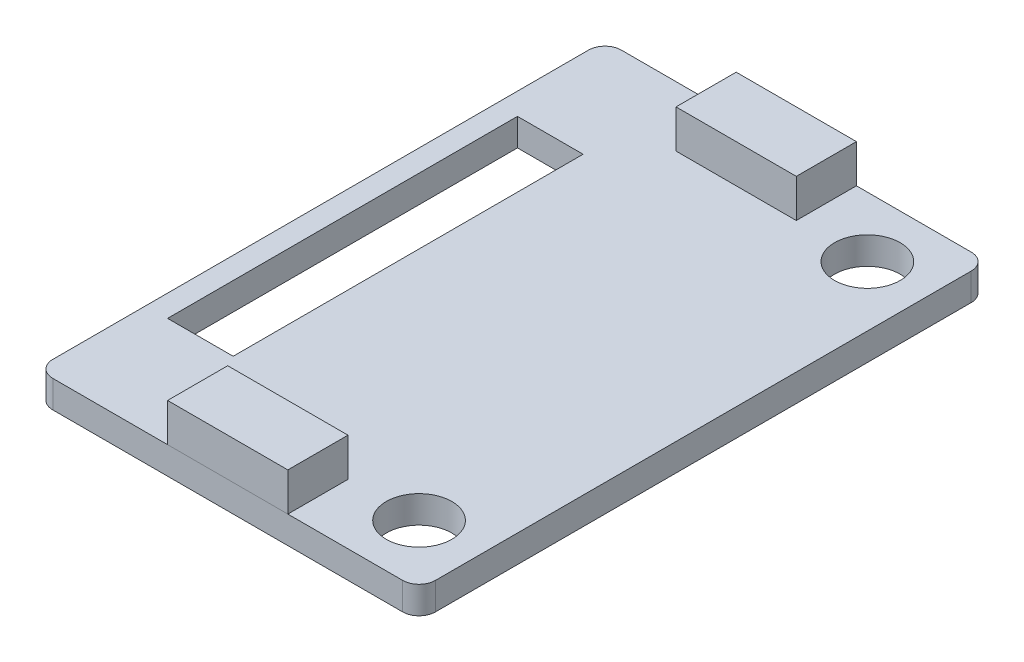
ISO-10303-21;
HEADER;
FILE_DESCRIPTION(('STEP AP214'),'2;1');
FILE_NAME('part.step','',(''),(''),'','','');
FILE_SCHEMA(('AUTOMOTIVE_DESIGN { 1 0 10303 214 1 1 1 1 }'));
ENDSEC;
DATA;
#1=APPLICATION_CONTEXT('core data for automotive mechanical design processes');
#2=APPLICATION_PROTOCOL_DEFINITION('international standard','automotive_design',2000,#1);
#3=PRODUCT_CONTEXT('',#1,'mechanical');
#4=PRODUCT('Part','Part','',(#3));
#5=PRODUCT_RELATED_PRODUCT_CATEGORY('part','',(#4));
#6=PRODUCT_DEFINITION_FORMATION('','',#4);
#7=PRODUCT_DEFINITION_CONTEXT('part definition',#1,'design');
#8=PRODUCT_DEFINITION('design','',#6,#7);
#9=PRODUCT_DEFINITION_SHAPE('','',#8);
#10=(LENGTH_UNIT() NAMED_UNIT(*) SI_UNIT(.MILLI.,.METRE.));
#11=(NAMED_UNIT(*) PLANE_ANGLE_UNIT() SI_UNIT($,.RADIAN.));
#12=(NAMED_UNIT(*) SI_UNIT($,.STERADIAN.) SOLID_ANGLE_UNIT());
#13=UNCERTAINTY_MEASURE_WITH_UNIT(LENGTH_MEASURE(1.E-05),#10,'distance_accuracy_value','');
#14=(GEOMETRIC_REPRESENTATION_CONTEXT(3) GLOBAL_UNCERTAINTY_ASSIGNED_CONTEXT((#13)) GLOBAL_UNIT_ASSIGNED_CONTEXT((#10,
#11,#12)) REPRESENTATION_CONTEXT('',''));
#15=CARTESIAN_POINT('',(0.,0.,0.));
#16=DIRECTION('',(0.,0.,1.));
#17=DIRECTION('',(1.,0.,0.));
#18=AXIS2_PLACEMENT_3D('',#15,#16,#17);
#19=CARTESIAN_POINT('',(-2.75,3.,-13.));
#20=DIRECTION('',(1.,0.,0.));
#21=DIRECTION('',(0.,0.,-1.));
#22=AXIS2_PLACEMENT_3D('',#19,#20,#21);
#23=PLANE('',#22);
#24=DIRECTION('',(0.,0.,1.));
#25=VECTOR('',#24,1.);
#26=CARTESIAN_POINT('',(-2.75,1.25,-13.));
#27=LINE('',#26,#25);
#28=CARTESIAN_POINT('',(-2.75,1.25,-13.));
#29=VERTEX_POINT('',#28);
#30=CARTESIAN_POINT('',(-2.75,1.25,-10.25));
#31=VERTEX_POINT('',#30);
#32=EDGE_CURVE('E115',#29,#31,#27,.T.);
#33=ORIENTED_EDGE('',*,*,#32,.T.);
#34=DIRECTION('',(0.,-1.,0.));
#35=VECTOR('',#34,1.);
#36=CARTESIAN_POINT('',(-2.75,3.,-10.25));
#37=LINE('',#36,#35);
#38=CARTESIAN_POINT('',(-2.75,3.,-10.25));
#39=VERTEX_POINT('',#38);
#40=EDGE_CURVE('E12',#39,#31,#37,.T.);
#41=ORIENTED_EDGE('',*,*,#40,.F.);
#42=DIRECTION('',(0.,0.,1.));
#43=VECTOR('',#42,1.);
#44=CARTESIAN_POINT('',(-2.75,3.,-13.));
#45=LINE('',#44,#43);
#46=CARTESIAN_POINT('',(-2.75,3.,-13.));
#47=VERTEX_POINT('',#46);
#48=EDGE_CURVE('E103',#47,#39,#45,.T.);
#49=ORIENTED_EDGE('',*,*,#48,.F.);
#50=DIRECTION('',(0.,-1.,0.));
#51=VECTOR('',#50,1.);
#52=CARTESIAN_POINT('',(-2.75,3.,-13.));
#53=LINE('',#52,#51);
#54=EDGE_CURVE('E111',#47,#29,#53,.T.);
#55=ORIENTED_EDGE('',*,*,#54,.T.);
#56=EDGE_LOOP('',(#33,#41,#49,#55));
#57=FACE_BOUND('',#56,.T.);
#58=ADVANCED_FACE('F52',(#57),#23,.F.);
#59=CARTESIAN_POINT('',(-2.75,3.,-10.25));
#60=DIRECTION('',(0.,0.,-1.));
#61=DIRECTION('',(-1.,0.,0.));
#62=AXIS2_PLACEMENT_3D('',#59,#60,#61);
#63=PLANE('',#62);
#64=DIRECTION('',(1.,0.,0.));
#65=VECTOR('',#64,1.);
#66=CARTESIAN_POINT('',(-2.75,1.25,-10.25));
#67=LINE('',#66,#65);
#68=CARTESIAN_POINT('',(2.75,1.25,-10.25));
#69=VERTEX_POINT('',#68);
#70=EDGE_CURVE('E107',#31,#69,#67,.T.);
#71=ORIENTED_EDGE('',*,*,#70,.T.);
#72=DIRECTION('',(0.,-1.,0.));
#73=VECTOR('',#72,1.);
#74=CARTESIAN_POINT('',(2.75,3.,-10.25));
#75=LINE('',#74,#73);
#76=CARTESIAN_POINT('',(2.75,3.,-10.25));
#77=VERTEX_POINT('',#76);
#78=EDGE_CURVE('E60',#77,#69,#75,.T.);
#79=ORIENTED_EDGE('',*,*,#78,.F.);
#80=DIRECTION('',(1.,0.,0.));
#81=VECTOR('',#80,1.);
#82=CARTESIAN_POINT('',(-2.75,3.,-10.25));
#83=LINE('',#82,#81);
#84=EDGE_CURVE('E98',#39,#77,#83,.T.);
#85=ORIENTED_EDGE('',*,*,#84,.F.);
#86=ORIENTED_EDGE('',*,*,#40,.T.);
#87=EDGE_LOOP('',(#71,#79,#85,#86));
#88=FACE_BOUND('',#87,.T.);
#89=ADVANCED_FACE('F106',(#88),#63,.F.);
#90=CARTESIAN_POINT('',(2.75,3.,-13.));
#91=DIRECTION('',(-1.,0.,0.));
#92=DIRECTION('',(0.,0.,1.));
#93=AXIS2_PLACEMENT_3D('',#90,#91,#92);
#94=PLANE('',#93);
#95=DIRECTION('',(0.,0.,-1.));
#96=VECTOR('',#95,1.);
#97=CARTESIAN_POINT('',(2.75,1.25,-13.));
#98=LINE('',#97,#96);
#99=CARTESIAN_POINT('',(2.75,1.25,-13.));
#100=VERTEX_POINT('',#99);
#101=EDGE_CURVE('E85',#69,#100,#98,.T.);
#102=ORIENTED_EDGE('',*,*,#101,.T.);
#103=DIRECTION('',(0.,-1.,0.));
#104=VECTOR('',#103,1.);
#105=CARTESIAN_POINT('',(2.75,3.,-13.));
#106=LINE('',#105,#104);
#107=CARTESIAN_POINT('',(2.75,3.,-13.));
#108=VERTEX_POINT('',#107);
#109=EDGE_CURVE('E108',#108,#100,#106,.T.);
#110=ORIENTED_EDGE('',*,*,#109,.F.);
#111=DIRECTION('',(0.,0.,-1.));
#112=VECTOR('',#111,1.);
#113=CARTESIAN_POINT('',(2.75,3.,-13.));
#114=LINE('',#113,#112);
#115=EDGE_CURVE('E101',#77,#108,#114,.T.);
#116=ORIENTED_EDGE('',*,*,#115,.F.);
#117=ORIENTED_EDGE('',*,*,#78,.T.);
#118=EDGE_LOOP('',(#102,#110,#116,#117));
#119=FACE_BOUND('',#118,.T.);
#120=ADVANCED_FACE('F109',(#119),#94,.F.);
#121=CARTESIAN_POINT('',(-2.75,3.,-13.));
#122=DIRECTION('',(0.,0.,1.));
#123=DIRECTION('',(1.,0.,0.));
#124=AXIS2_PLACEMENT_3D('',#121,#122,#123);
#125=PLANE('',#124);
#126=DIRECTION('',(-1.,0.,0.));
#127=VECTOR('',#126,1.);
#128=CARTESIAN_POINT('',(-2.75,1.25,-13.));
#129=LINE('',#128,#127);
#130=EDGE_CURVE('E91',#100,#29,#129,.T.);
#131=ORIENTED_EDGE('',*,*,#130,.T.);
#132=ORIENTED_EDGE('',*,*,#54,.F.);
#133=DIRECTION('',(-1.,0.,0.));
#134=VECTOR('',#133,1.);
#135=CARTESIAN_POINT('',(-2.75,3.,-13.));
#136=LINE('',#135,#134);
#137=EDGE_CURVE('E68',#108,#47,#136,.T.);
#138=ORIENTED_EDGE('',*,*,#137,.F.);
#139=ORIENTED_EDGE('',*,*,#109,.T.);
#140=EDGE_LOOP('',(#131,#132,#138,#139));
#141=FACE_BOUND('',#140,.T.);
#142=ADVANCED_FACE('F122',(#141),#125,.F.);
#143=CARTESIAN_POINT('',(0.,3.,0.));
#144=DIRECTION('',(0.,1.,0.));
#145=DIRECTION('',(0.,0.,1.));
#146=AXIS2_PLACEMENT_3D('',#143,#144,#145);
#147=PLANE('',#146);
#148=ORIENTED_EDGE('',*,*,#48,.T.);
#149=ORIENTED_EDGE('',*,*,#84,.T.);
#150=ORIENTED_EDGE('',*,*,#115,.T.);
#151=ORIENTED_EDGE('',*,*,#137,.T.);
#152=EDGE_LOOP('',(#148,#149,#150,#151));
#153=FACE_BOUND('',#152,.T.);
#154=ADVANCED_FACE('F99',(#153),#147,.T.);
#155=CARTESIAN_POINT('',(0.,1.25,0.));
#156=DIRECTION('',(0.,1.,0.));
#157=DIRECTION('',(0.,0.,1.));
#158=AXIS2_PLACEMENT_3D('',#155,#156,#157);
#159=PLANE('',#158);
#160=ORIENTED_EDGE('',*,*,#32,.F.);
#161=ORIENTED_EDGE('',*,*,#130,.F.);
#162=ORIENTED_EDGE('',*,*,#101,.F.);
#163=ORIENTED_EDGE('',*,*,#70,.F.);
#164=EDGE_LOOP('',(#160,#161,#162,#163));
#165=FACE_BOUND('',#164,.T.);
#166=ADVANCED_FACE('F125',(#165),#159,.F.);
#167=CLOSED_SHELL('',(#58,#89,#120,#142,#154,#166));
#168=MANIFOLD_SOLID_BREP('B2',#167);
#169=CARTESIAN_POINT('',(2.75,3.,13.));
#170=DIRECTION('',(-1.,0.,0.));
#171=DIRECTION('',(0.,0.,1.));
#172=AXIS2_PLACEMENT_3D('',#169,#170,#171);
#173=PLANE('',#172);
#174=DIRECTION('',(0.,0.,-1.));
#175=VECTOR('',#174,1.);
#176=CARTESIAN_POINT('',(2.75,1.25,13.));
#177=LINE('',#176,#175);
#178=CARTESIAN_POINT('',(2.75,1.25,13.));
#179=VERTEX_POINT('',#178);
#180=CARTESIAN_POINT('',(2.75,1.25,10.25));
#181=VERTEX_POINT('',#180);
#182=EDGE_CURVE('E248',#179,#181,#177,.T.);
#183=ORIENTED_EDGE('',*,*,#182,.T.);
#184=DIRECTION('',(0.,-1.,0.));
#185=VECTOR('',#184,1.);
#186=CARTESIAN_POINT('',(2.75,3.,10.25));
#187=LINE('',#186,#185);
#188=CARTESIAN_POINT('',(2.75,3.,10.25));
#189=VERTEX_POINT('',#188);
#190=EDGE_CURVE('E50',#189,#181,#187,.T.);
#191=ORIENTED_EDGE('',*,*,#190,.F.);
#192=DIRECTION('',(0.,0.,-1.));
#193=VECTOR('',#192,1.);
#194=CARTESIAN_POINT('',(2.75,3.,13.));
#195=LINE('',#194,#193);
#196=CARTESIAN_POINT('',(2.75,3.,13.));
#197=VERTEX_POINT('',#196);
#198=EDGE_CURVE('E236',#197,#189,#195,.T.);
#199=ORIENTED_EDGE('',*,*,#198,.F.);
#200=DIRECTION('',(0.,-1.,0.));
#201=VECTOR('',#200,1.);
#202=CARTESIAN_POINT('',(2.75,3.,13.));
#203=LINE('',#202,#201);
#204=EDGE_CURVE('E244',#197,#179,#203,.T.);
#205=ORIENTED_EDGE('',*,*,#204,.T.);
#206=EDGE_LOOP('',(#183,#191,#199,#205));
#207=FACE_BOUND('',#206,.T.);
#208=ADVANCED_FACE('F185',(#207),#173,.F.);
#209=CARTESIAN_POINT('',(-2.75,3.,10.25));
#210=DIRECTION('',(0.,0.,1.));
#211=DIRECTION('',(1.,0.,0.));
#212=AXIS2_PLACEMENT_3D('',#209,#210,#211);
#213=PLANE('',#212);
#214=DIRECTION('',(-1.,0.,0.));
#215=VECTOR('',#214,1.);
#216=CARTESIAN_POINT('',(-2.75,1.25,10.25));
#217=LINE('',#216,#215);
#218=CARTESIAN_POINT('',(-2.75,1.25,10.25));
#219=VERTEX_POINT('',#218);
#220=EDGE_CURVE('E240',#181,#219,#217,.T.);
#221=ORIENTED_EDGE('',*,*,#220,.T.);
#222=DIRECTION('',(0.,-1.,0.));
#223=VECTOR('',#222,1.);
#224=CARTESIAN_POINT('',(-2.75,3.,10.25));
#225=LINE('',#224,#223);
#226=CARTESIAN_POINT('',(-2.75,3.,10.25));
#227=VERTEX_POINT('',#226);
#228=EDGE_CURVE('E193',#227,#219,#225,.T.);
#229=ORIENTED_EDGE('',*,*,#228,.F.);
#230=DIRECTION('',(-1.,0.,0.));
#231=VECTOR('',#230,1.);
#232=CARTESIAN_POINT('',(-2.75,3.,10.25));
#233=LINE('',#232,#231);
#234=EDGE_CURVE('E231',#189,#227,#233,.T.);
#235=ORIENTED_EDGE('',*,*,#234,.F.);
#236=ORIENTED_EDGE('',*,*,#190,.T.);
#237=EDGE_LOOP('',(#221,#229,#235,#236));
#238=FACE_BOUND('',#237,.T.);
#239=ADVANCED_FACE('F239',(#238),#213,.F.);
#240=CARTESIAN_POINT('',(-2.75,3.,13.));
#241=DIRECTION('',(1.,0.,0.));
#242=DIRECTION('',(0.,0.,-1.));
#243=AXIS2_PLACEMENT_3D('',#240,#241,#242);
#244=PLANE('',#243);
#245=DIRECTION('',(0.,0.,1.));
#246=VECTOR('',#245,1.);
#247=CARTESIAN_POINT('',(-2.75,1.25,13.));
#248=LINE('',#247,#246);
#249=CARTESIAN_POINT('',(-2.75,1.25,13.));
#250=VERTEX_POINT('',#249);
#251=EDGE_CURVE('E218',#219,#250,#248,.T.);
#252=ORIENTED_EDGE('',*,*,#251,.T.);
#253=DIRECTION('',(0.,-1.,0.));
#254=VECTOR('',#253,1.);
#255=CARTESIAN_POINT('',(-2.75,3.,13.));
#256=LINE('',#255,#254);
#257=CARTESIAN_POINT('',(-2.75,3.,13.));
#258=VERTEX_POINT('',#257);
#259=EDGE_CURVE('E241',#258,#250,#256,.T.);
#260=ORIENTED_EDGE('',*,*,#259,.F.);
#261=DIRECTION('',(0.,0.,1.));
#262=VECTOR('',#261,1.);
#263=CARTESIAN_POINT('',(-2.75,3.,13.));
#264=LINE('',#263,#262);
#265=EDGE_CURVE('E234',#227,#258,#264,.T.);
#266=ORIENTED_EDGE('',*,*,#265,.F.);
#267=ORIENTED_EDGE('',*,*,#228,.T.);
#268=EDGE_LOOP('',(#252,#260,#266,#267));
#269=FACE_BOUND('',#268,.T.);
#270=ADVANCED_FACE('F242',(#269),#244,.F.);
#271=CARTESIAN_POINT('',(-2.75,3.,13.));
#272=DIRECTION('',(0.,0.,-1.));
#273=DIRECTION('',(-1.,0.,0.));
#274=AXIS2_PLACEMENT_3D('',#271,#272,#273);
#275=PLANE('',#274);
#276=DIRECTION('',(1.,0.,0.));
#277=VECTOR('',#276,1.);
#278=CARTESIAN_POINT('',(-2.75,1.25,13.));
#279=LINE('',#278,#277);
#280=EDGE_CURVE('E224',#250,#179,#279,.T.);
#281=ORIENTED_EDGE('',*,*,#280,.T.);
#282=ORIENTED_EDGE('',*,*,#204,.F.);
#283=DIRECTION('',(1.,0.,0.));
#284=VECTOR('',#283,1.);
#285=CARTESIAN_POINT('',(-2.75,3.,13.));
#286=LINE('',#285,#284);
#287=EDGE_CURVE('E201',#258,#197,#286,.T.);
#288=ORIENTED_EDGE('',*,*,#287,.F.);
#289=ORIENTED_EDGE('',*,*,#259,.T.);
#290=EDGE_LOOP('',(#281,#282,#288,#289));
#291=FACE_BOUND('',#290,.T.);
#292=ADVANCED_FACE('F255',(#291),#275,.F.);
#293=CARTESIAN_POINT('',(0.,3.,0.));
#294=DIRECTION('',(0.,-1.,0.));
#295=DIRECTION('',(0.,0.,-1.));
#296=AXIS2_PLACEMENT_3D('',#293,#294,#295);
#297=PLANE('',#296);
#298=ORIENTED_EDGE('',*,*,#198,.T.);
#299=ORIENTED_EDGE('',*,*,#234,.T.);
#300=ORIENTED_EDGE('',*,*,#265,.T.);
#301=ORIENTED_EDGE('',*,*,#287,.T.);
#302=EDGE_LOOP('',(#298,#299,#300,#301));
#303=FACE_BOUND('',#302,.T.);
#304=ADVANCED_FACE('F232',(#303),#297,.F.);
#305=CARTESIAN_POINT('',(0.,1.25,0.));
#306=DIRECTION('',(0.,-1.,0.));
#307=DIRECTION('',(0.,0.,-1.));
#308=AXIS2_PLACEMENT_3D('',#305,#306,#307);
#309=PLANE('',#308);
#310=ORIENTED_EDGE('',*,*,#182,.F.);
#311=ORIENTED_EDGE('',*,*,#280,.F.);
#312=ORIENTED_EDGE('',*,*,#251,.F.);
#313=ORIENTED_EDGE('',*,*,#220,.F.);
#314=EDGE_LOOP('',(#310,#311,#312,#313));
#315=FACE_BOUND('',#314,.T.);
#316=ADVANCED_FACE('F258',(#315),#309,.T.);
#317=CLOSED_SHELL('',(#208,#239,#270,#292,#304,#316));
#318=MANIFOLD_SOLID_BREP('B6',#317);
#319=CARTESIAN_POINT('',(0.,1.25,0.));
#320=DIRECTION('',(0.,-1.,0.));
#321=DIRECTION('',(0.,0.,-1.));
#322=AXIS2_PLACEMENT_3D('',#319,#320,#321);
#323=PLANE('',#322);
#324=DIRECTION('',(0.,0.,-1.));
#325=VECTOR('',#324,1.);
#326=CARTESIAN_POINT('',(8.75,1.25,13.));
#327=LINE('',#326,#325);
#328=CARTESIAN_POINT('',(8.75,1.25,12.25));
#329=VERTEX_POINT('',#328);
#330=CARTESIAN_POINT('',(8.75,1.25,-12.25));
#331=VERTEX_POINT('',#330);
#332=EDGE_CURVE('E457',#329,#331,#327,.T.);
#333=ORIENTED_EDGE('',*,*,#332,.T.);
#334=CARTESIAN_POINT('',(8.,1.25,-12.25));
#335=DIRECTION('',(0.,-1.,0.));
#336=DIRECTION('',(0.,0.,-1.));
#337=AXIS2_PLACEMENT_3D('',#334,#335,#336);
#338=CIRCLE('',#337,0.75);
#339=CARTESIAN_POINT('',(8.,1.25,-13.));
#340=VERTEX_POINT('',#339);
#341=EDGE_CURVE('E519',#331,#340,#338,.F.);
#342=ORIENTED_EDGE('',*,*,#341,.T.);
#343=DIRECTION('',(-1.,0.,0.));
#344=VECTOR('',#343,1.);
#345=CARTESIAN_POINT('',(-8.75,1.25,-13.));
#346=LINE('',#345,#344);
#347=CARTESIAN_POINT('',(-8.,1.25,-13.));
#348=VERTEX_POINT('',#347);
#349=EDGE_CURVE('E461',#340,#348,#346,.T.);
#350=ORIENTED_EDGE('',*,*,#349,.T.);
#351=CARTESIAN_POINT('',(-8.,1.25,-12.25));
#352=DIRECTION('',(0.,-1.,0.));
#353=DIRECTION('',(0.,0.,-1.));
#354=AXIS2_PLACEMENT_3D('',#351,#352,#353);
#355=CIRCLE('',#354,0.75);
#356=CARTESIAN_POINT('',(-8.75,1.25,-12.25));
#357=VERTEX_POINT('',#356);
#358=EDGE_CURVE('E516',#348,#357,#355,.F.);
#359=ORIENTED_EDGE('',*,*,#358,.T.);
#360=DIRECTION('',(0.,0.,1.));
#361=VECTOR('',#360,1.);
#362=CARTESIAN_POINT('',(-8.75,1.25,13.));
#363=LINE('',#362,#361);
#364=CARTESIAN_POINT('',(-8.75,1.25,12.25));
#365=VERTEX_POINT('',#364);
#366=EDGE_CURVE('E466',#357,#365,#363,.T.);
#367=ORIENTED_EDGE('',*,*,#366,.T.);
#368=CARTESIAN_POINT('',(-8.,1.25,12.25));
#369=DIRECTION('',(0.,-1.,0.));
#370=DIRECTION('',(0.,0.,-1.));
#371=AXIS2_PLACEMENT_3D('',#368,#369,#370);
#372=CIRCLE('',#371,0.75);
#373=CARTESIAN_POINT('',(-8.,1.25,13.));
#374=VERTEX_POINT('',#373);
#375=EDGE_CURVE('E331',#365,#374,#372,.F.);
#376=ORIENTED_EDGE('',*,*,#375,.T.);
#377=DIRECTION('',(1.,0.,0.));
#378=VECTOR('',#377,1.);
#379=CARTESIAN_POINT('',(-8.75,1.25,13.));
#380=LINE('',#379,#378);
#381=CARTESIAN_POINT('',(8.,1.25,13.));
#382=VERTEX_POINT('',#381);
#383=EDGE_CURVE('E469',#374,#382,#380,.T.);
#384=ORIENTED_EDGE('',*,*,#383,.T.);
#385=CARTESIAN_POINT('',(8.,1.25,12.25));
#386=DIRECTION('',(0.,-1.,0.));
#387=DIRECTION('',(0.,0.,-1.));
#388=AXIS2_PLACEMENT_3D('',#385,#386,#387);
#389=CIRCLE('',#388,0.75);
#390=EDGE_CURVE('E511',#382,#329,#389,.F.);
#391=ORIENTED_EDGE('',*,*,#390,.T.);
#392=EDGE_LOOP('',(#333,#342,#350,#359,#367,#376,#384,#391));
#393=FACE_BOUND('',#392,.T.);
#394=DIRECTION('',(0.,0.,-1.));
#395=VECTOR('',#394,1.);
#396=CARTESIAN_POINT('',(-4.75,1.25,8.));
#397=LINE('',#396,#395);
#398=CARTESIAN_POINT('',(-4.75,1.25,8.));
#399=VERTEX_POINT('',#398);
#400=CARTESIAN_POINT('',(-4.75,1.25,-8.));
#401=VERTEX_POINT('',#400);
#402=EDGE_CURVE('E401',#399,#401,#397,.T.);
#403=ORIENTED_EDGE('',*,*,#402,.F.);
#404=DIRECTION('',(1.,0.,0.));
#405=VECTOR('',#404,1.);
#406=CARTESIAN_POINT('',(-7.75,1.25,8.));
#407=LINE('',#406,#405);
#408=CARTESIAN_POINT('',(-7.75,1.25,8.));
#409=VERTEX_POINT('',#408);
#410=EDGE_CURVE('E431',#409,#399,#407,.T.);
#411=ORIENTED_EDGE('',*,*,#410,.F.);
#412=DIRECTION('',(0.,0.,1.));
#413=VECTOR('',#412,1.);
#414=CARTESIAN_POINT('',(-7.75,1.25,8.));
#415=LINE('',#414,#413);
#416=CARTESIAN_POINT('',(-7.75,1.25,-8.));
#417=VERTEX_POINT('',#416);
#418=EDGE_CURVE('E427',#417,#409,#415,.T.);
#419=ORIENTED_EDGE('',*,*,#418,.F.);
#420=DIRECTION('',(-1.,0.,0.));
#421=VECTOR('',#420,1.);
#422=CARTESIAN_POINT('',(-7.75,1.25,-8.));
#423=LINE('',#422,#421);
#424=EDGE_CURVE('E412',#401,#417,#423,.T.);
#425=ORIENTED_EDGE('',*,*,#424,.F.);
#426=EDGE_LOOP('',(#403,#411,#419,#425));
#427=FACE_BOUND('',#426,.T.);
#428=CARTESIAN_POINT('',(6.,1.25,-10.25));
#429=DIRECTION('',(0.,1.,0.));
#430=DIRECTION('',(0.,0.,1.));
#431=AXIS2_PLACEMENT_3D('',#428,#429,#430);
#432=CIRCLE('',#431,1.5);
#433=CARTESIAN_POINT('',(6.,1.25,-8.75));
#434=VERTEX_POINT('',#433);
#435=EDGE_CURVE('E440',#434,#434,#432,.T.);
#436=ORIENTED_EDGE('',*,*,#435,.F.);
#437=EDGE_LOOP('',(#436));
#438=FACE_BOUND('',#437,.T.);
#439=CARTESIAN_POINT('',(6.,1.25,10.25));
#440=DIRECTION('',(0.,1.,0.));
#441=DIRECTION('',(0.,0.,-1.));
#442=AXIS2_PLACEMENT_3D('',#439,#440,#441);
#443=CIRCLE('',#442,1.5);
#444=CARTESIAN_POINT('',(6.,1.25,8.75));
#445=VERTEX_POINT('',#444);
#446=EDGE_CURVE('E701',#445,#445,#443,.T.);
#447=ORIENTED_EDGE('',*,*,#446,.F.);
#448=EDGE_LOOP('',(#447));
#449=FACE_BOUND('',#448,.T.);
#450=ADVANCED_FACE('F309',(#393,#427,#438,#449),#323,.F.);
#451=CARTESIAN_POINT('',(0.,0.,0.));
#452=DIRECTION('',(0.,-1.,0.));
#453=DIRECTION('',(0.,0.,-1.));
#454=AXIS2_PLACEMENT_3D('',#451,#452,#453);
#455=PLANE('',#454);
#456=CARTESIAN_POINT('',(6.,0.,-10.25));
#457=DIRECTION('',(0.,1.,0.));
#458=DIRECTION('',(0.,0.,1.));
#459=AXIS2_PLACEMENT_3D('',#456,#457,#458);
#460=CIRCLE('',#459,1.5);
#461=CARTESIAN_POINT('',(6.,0.,-8.75));
#462=VERTEX_POINT('',#461);
#463=EDGE_CURVE('E709',#462,#462,#460,.T.);
#464=ORIENTED_EDGE('',*,*,#463,.T.);
#465=EDGE_LOOP('',(#464));
#466=FACE_BOUND('',#465,.T.);
#467=DIRECTION('',(-1.,0.,0.));
#468=VECTOR('',#467,1.);
#469=CARTESIAN_POINT('',(-8.75,0.,-13.));
#470=LINE('',#469,#468);
#471=CARTESIAN_POINT('',(8.,0.,-13.));
#472=VERTEX_POINT('',#471);
#473=CARTESIAN_POINT('',(-8.,0.,-13.));
#474=VERTEX_POINT('',#473);
#475=EDGE_CURVE('E476',#472,#474,#470,.T.);
#476=ORIENTED_EDGE('',*,*,#475,.F.);
#477=CARTESIAN_POINT('',(8.,0.,-12.25));
#478=DIRECTION('',(0.,-1.,0.));
#479=DIRECTION('',(0.,0.,-1.));
#480=AXIS2_PLACEMENT_3D('',#477,#478,#479);
#481=CIRCLE('',#480,0.75);
#482=CARTESIAN_POINT('',(8.75,0.,-12.25));
#483=VERTEX_POINT('',#482);
#484=EDGE_CURVE('E501',#472,#483,#481,.T.);
#485=ORIENTED_EDGE('',*,*,#484,.T.);
#486=DIRECTION('',(0.,0.,-1.));
#487=VECTOR('',#486,1.);
#488=CARTESIAN_POINT('',(8.75,0.,13.));
#489=LINE('',#488,#487);
#490=CARTESIAN_POINT('',(8.75,0.,12.25));
#491=VERTEX_POINT('',#490);
#492=EDGE_CURVE('E421',#491,#483,#489,.T.);
#493=ORIENTED_EDGE('',*,*,#492,.F.);
#494=CARTESIAN_POINT('',(8.,0.,12.25));
#495=DIRECTION('',(0.,-1.,0.));
#496=DIRECTION('',(0.,0.,-1.));
#497=AXIS2_PLACEMENT_3D('',#494,#495,#496);
#498=CIRCLE('',#497,0.75);
#499=CARTESIAN_POINT('',(8.,0.,13.));
#500=VERTEX_POINT('',#499);
#501=EDGE_CURVE('E492',#491,#500,#498,.T.);
#502=ORIENTED_EDGE('',*,*,#501,.T.);
#503=DIRECTION('',(1.,0.,0.));
#504=VECTOR('',#503,1.);
#505=CARTESIAN_POINT('',(-8.75,0.,13.));
#506=LINE('',#505,#504);
#507=CARTESIAN_POINT('',(-8.,0.,13.));
#508=VERTEX_POINT('',#507);
#509=EDGE_CURVE('E462',#508,#500,#506,.T.);
#510=ORIENTED_EDGE('',*,*,#509,.F.);
#511=CARTESIAN_POINT('',(-8.,0.,12.25));
#512=DIRECTION('',(0.,-1.,0.));
#513=DIRECTION('',(0.,0.,-1.));
#514=AXIS2_PLACEMENT_3D('',#511,#512,#513);
#515=CIRCLE('',#514,0.75);
#516=CARTESIAN_POINT('',(-8.75,0.,12.25));
#517=VERTEX_POINT('',#516);
#518=EDGE_CURVE('E495',#508,#517,#515,.T.);
#519=ORIENTED_EDGE('',*,*,#518,.T.);
#520=DIRECTION('',(0.,0.,1.));
#521=VECTOR('',#520,1.);
#522=CARTESIAN_POINT('',(-8.75,0.,13.));
#523=LINE('',#522,#521);
#524=CARTESIAN_POINT('',(-8.75,0.,-12.25));
#525=VERTEX_POINT('',#524);
#526=EDGE_CURVE('E480',#525,#517,#523,.T.);
#527=ORIENTED_EDGE('',*,*,#526,.F.);
#528=CARTESIAN_POINT('',(-8.,0.,-12.25));
#529=DIRECTION('',(0.,-1.,0.));
#530=DIRECTION('',(0.,0.,-1.));
#531=AXIS2_PLACEMENT_3D('',#528,#529,#530);
#532=CIRCLE('',#531,0.75);
#533=EDGE_CURVE('E498',#525,#474,#532,.T.);
#534=ORIENTED_EDGE('',*,*,#533,.T.);
#535=EDGE_LOOP('',(#476,#485,#493,#502,#510,#519,#527,#534));
#536=FACE_BOUND('',#535,.T.);
#537=DIRECTION('',(1.,0.,0.));
#538=VECTOR('',#537,1.);
#539=CARTESIAN_POINT('',(-7.75,0.,8.));
#540=LINE('',#539,#538);
#541=CARTESIAN_POINT('',(-7.75,0.,8.));
#542=VERTEX_POINT('',#541);
#543=CARTESIAN_POINT('',(-4.75,0.,8.));
#544=VERTEX_POINT('',#543);
#545=EDGE_CURVE('E413',#542,#544,#540,.T.);
#546=ORIENTED_EDGE('',*,*,#545,.T.);
#547=DIRECTION('',(0.,0.,-1.));
#548=VECTOR('',#547,1.);
#549=CARTESIAN_POINT('',(-4.75,0.,8.));
#550=LINE('',#549,#548);
#551=CARTESIAN_POINT('',(-4.75,0.,-8.));
#552=VERTEX_POINT('',#551);
#553=EDGE_CURVE('E437',#544,#552,#550,.T.);
#554=ORIENTED_EDGE('',*,*,#553,.T.);
#555=DIRECTION('',(-1.,0.,0.));
#556=VECTOR('',#555,1.);
#557=CARTESIAN_POINT('',(-7.75,0.,-8.));
#558=LINE('',#557,#556);
#559=CARTESIAN_POINT('',(-7.75,0.,-8.));
#560=VERTEX_POINT('',#559);
#561=EDGE_CURVE('E419',#552,#560,#558,.T.);
#562=ORIENTED_EDGE('',*,*,#561,.T.);
#563=DIRECTION('',(0.,0.,1.));
#564=VECTOR('',#563,1.);
#565=CARTESIAN_POINT('',(-7.75,0.,8.));
#566=LINE('',#565,#564);
#567=EDGE_CURVE('E443',#560,#542,#566,.T.);
#568=ORIENTED_EDGE('',*,*,#567,.T.);
#569=EDGE_LOOP('',(#546,#554,#562,#568));
#570=FACE_BOUND('',#569,.T.);
#571=CARTESIAN_POINT('',(6.,0.,10.25));
#572=DIRECTION('',(0.,1.,0.));
#573=DIRECTION('',(0.,0.,-1.));
#574=AXIS2_PLACEMENT_3D('',#571,#572,#573);
#575=CIRCLE('',#574,1.5);
#576=CARTESIAN_POINT('',(6.,0.,8.75));
#577=VERTEX_POINT('',#576);
#578=EDGE_CURVE('E704',#577,#577,#575,.T.);
#579=ORIENTED_EDGE('',*,*,#578,.T.);
#580=EDGE_LOOP('',(#579));
#581=FACE_BOUND('',#580,.T.);
#582=ADVANCED_FACE('F539',(#466,#536,#570,#581),#455,.T.);
#583=CARTESIAN_POINT('',(8.75,1.25,13.));
#584=DIRECTION('',(-1.,0.,0.));
#585=DIRECTION('',(0.,0.,1.));
#586=AXIS2_PLACEMENT_3D('',#583,#584,#585);
#587=PLANE('',#586);
#588=ORIENTED_EDGE('',*,*,#492,.T.);
#589=DIRECTION('',(0.,-1.,0.));
#590=VECTOR('',#589,1.);
#591=CARTESIAN_POINT('',(8.75,1.25,-12.25));
#592=LINE('',#591,#590);
#593=EDGE_CURVE('E508',#483,#331,#592,.F.);
#594=ORIENTED_EDGE('',*,*,#593,.T.);
#595=ORIENTED_EDGE('',*,*,#332,.F.);
#596=DIRECTION('',(0.,-1.,0.));
#597=VECTOR('',#596,1.);
#598=CARTESIAN_POINT('',(8.75,1.25,12.25));
#599=LINE('',#598,#597);
#600=EDGE_CURVE('E504',#329,#491,#599,.T.);
#601=ORIENTED_EDGE('',*,*,#600,.T.);
#602=EDGE_LOOP('',(#588,#594,#595,#601));
#603=FACE_BOUND('',#602,.T.);
#604=ADVANCED_FACE('F552',(#603),#587,.F.);
#605=CARTESIAN_POINT('',(-8.75,1.25,-13.));
#606=DIRECTION('',(0.,0.,1.));
#607=DIRECTION('',(1.,0.,0.));
#608=AXIS2_PLACEMENT_3D('',#605,#606,#607);
#609=PLANE('',#608);
#610=ORIENTED_EDGE('',*,*,#349,.F.);
#611=DIRECTION('',(0.,-1.,0.));
#612=VECTOR('',#611,1.);
#613=CARTESIAN_POINT('',(8.,1.25,-13.));
#614=LINE('',#613,#612);
#615=EDGE_CURVE('E488',#340,#472,#614,.T.);
#616=ORIENTED_EDGE('',*,*,#615,.T.);
#617=ORIENTED_EDGE('',*,*,#475,.T.);
#618=DIRECTION('',(0.,-1.,0.));
#619=VECTOR('',#618,1.);
#620=CARTESIAN_POINT('',(-8.,1.25,-13.));
#621=LINE('',#620,#619);
#622=EDGE_CURVE('E472',#474,#348,#621,.F.);
#623=ORIENTED_EDGE('',*,*,#622,.T.);
#624=EDGE_LOOP('',(#610,#616,#617,#623));
#625=FACE_BOUND('',#624,.T.);
#626=ADVANCED_FACE('F560',(#625),#609,.F.);
#627=CARTESIAN_POINT('',(-8.75,1.25,13.));
#628=DIRECTION('',(1.,0.,0.));
#629=DIRECTION('',(0.,0.,-1.));
#630=AXIS2_PLACEMENT_3D('',#627,#628,#629);
#631=PLANE('',#630);
#632=ORIENTED_EDGE('',*,*,#366,.F.);
#633=DIRECTION('',(0.,-1.,0.));
#634=VECTOR('',#633,1.);
#635=CARTESIAN_POINT('',(-8.75,1.25,-12.25));
#636=LINE('',#635,#634);
#637=EDGE_CURVE('E525',#357,#525,#636,.T.);
#638=ORIENTED_EDGE('',*,*,#637,.T.);
#639=ORIENTED_EDGE('',*,*,#526,.T.);
#640=DIRECTION('',(0.,-1.,0.));
#641=VECTOR('',#640,1.);
#642=CARTESIAN_POINT('',(-8.75,1.25,12.25));
#643=LINE('',#642,#641);
#644=EDGE_CURVE('E522',#517,#365,#643,.F.);
#645=ORIENTED_EDGE('',*,*,#644,.T.);
#646=EDGE_LOOP('',(#632,#638,#639,#645));
#647=FACE_BOUND('',#646,.T.);
#648=ADVANCED_FACE('F533',(#647),#631,.F.);
#649=CARTESIAN_POINT('',(-8.75,1.25,13.));
#650=DIRECTION('',(0.,0.,-1.));
#651=DIRECTION('',(-1.,0.,0.));
#652=AXIS2_PLACEMENT_3D('',#649,#650,#651);
#653=PLANE('',#652);
#654=ORIENTED_EDGE('',*,*,#383,.F.);
#655=DIRECTION('',(0.,-1.,0.));
#656=VECTOR('',#655,1.);
#657=CARTESIAN_POINT('',(-8.,1.25,13.));
#658=LINE('',#657,#656);
#659=EDGE_CURVE('E183',#374,#508,#658,.T.);
#660=ORIENTED_EDGE('',*,*,#659,.T.);
#661=ORIENTED_EDGE('',*,*,#509,.T.);
#662=DIRECTION('',(0.,-1.,0.));
#663=VECTOR('',#662,1.);
#664=CARTESIAN_POINT('',(8.,1.25,13.));
#665=LINE('',#664,#663);
#666=EDGE_CURVE('E318',#500,#382,#665,.F.);
#667=ORIENTED_EDGE('',*,*,#666,.T.);
#668=EDGE_LOOP('',(#654,#660,#661,#667));
#669=FACE_BOUND('',#668,.T.);
#670=ADVANCED_FACE('F545',(#669),#653,.F.);
#671=CARTESIAN_POINT('',(-4.75,1.25,8.));
#672=DIRECTION('',(-1.,0.,0.));
#673=DIRECTION('',(0.,0.,1.));
#674=AXIS2_PLACEMENT_3D('',#671,#672,#673);
#675=PLANE('',#674);
#676=ORIENTED_EDGE('',*,*,#553,.F.);
#677=DIRECTION('',(0.,-1.,0.));
#678=VECTOR('',#677,1.);
#679=CARTESIAN_POINT('',(-4.75,1.25,8.));
#680=LINE('',#679,#678);
#681=EDGE_CURVE('E407',#399,#544,#680,.T.);
#682=ORIENTED_EDGE('',*,*,#681,.F.);
#683=ORIENTED_EDGE('',*,*,#402,.T.);
#684=DIRECTION('',(0.,-1.,0.));
#685=VECTOR('',#684,1.);
#686=CARTESIAN_POINT('',(-4.75,1.25,-8.));
#687=LINE('',#686,#685);
#688=EDGE_CURVE('E404',#401,#552,#687,.T.);
#689=ORIENTED_EDGE('',*,*,#688,.T.);
#690=EDGE_LOOP('',(#676,#682,#683,#689));
#691=FACE_BOUND('',#690,.T.);
#692=ADVANCED_FACE('F403',(#691),#675,.T.);
#693=CARTESIAN_POINT('',(-7.75,1.25,-8.));
#694=DIRECTION('',(0.,0.,1.));
#695=DIRECTION('',(1.,0.,0.));
#696=AXIS2_PLACEMENT_3D('',#693,#694,#695);
#697=PLANE('',#696);
#698=ORIENTED_EDGE('',*,*,#561,.F.);
#699=ORIENTED_EDGE('',*,*,#688,.F.);
#700=ORIENTED_EDGE('',*,*,#424,.T.);
#701=DIRECTION('',(0.,-1.,0.));
#702=VECTOR('',#701,1.);
#703=CARTESIAN_POINT('',(-7.75,1.25,-8.));
#704=LINE('',#703,#702);
#705=EDGE_CURVE('E422',#417,#560,#704,.T.);
#706=ORIENTED_EDGE('',*,*,#705,.T.);
#707=EDGE_LOOP('',(#698,#699,#700,#706));
#708=FACE_BOUND('',#707,.T.);
#709=ADVANCED_FACE('F416',(#708),#697,.T.);
#710=CARTESIAN_POINT('',(-7.75,1.25,8.));
#711=DIRECTION('',(1.,0.,0.));
#712=DIRECTION('',(0.,0.,-1.));
#713=AXIS2_PLACEMENT_3D('',#710,#711,#712);
#714=PLANE('',#713);
#715=ORIENTED_EDGE('',*,*,#567,.F.);
#716=ORIENTED_EDGE('',*,*,#705,.F.);
#717=ORIENTED_EDGE('',*,*,#418,.T.);
#718=DIRECTION('',(0.,-1.,0.));
#719=VECTOR('',#718,1.);
#720=CARTESIAN_POINT('',(-7.75,1.25,8.));
#721=LINE('',#720,#719);
#722=EDGE_CURVE('E452',#409,#542,#721,.T.);
#723=ORIENTED_EDGE('',*,*,#722,.T.);
#724=EDGE_LOOP('',(#715,#716,#717,#723));
#725=FACE_BOUND('',#724,.T.);
#726=ADVANCED_FACE('F616',(#725),#714,.T.);
#727=CARTESIAN_POINT('',(-7.75,1.25,8.));
#728=DIRECTION('',(0.,0.,-1.));
#729=DIRECTION('',(-1.,0.,0.));
#730=AXIS2_PLACEMENT_3D('',#727,#728,#729);
#731=PLANE('',#730);
#732=ORIENTED_EDGE('',*,*,#545,.F.);
#733=ORIENTED_EDGE('',*,*,#722,.F.);
#734=ORIENTED_EDGE('',*,*,#410,.T.);
#735=ORIENTED_EDGE('',*,*,#681,.T.);
#736=EDGE_LOOP('',(#732,#733,#734,#735));
#737=FACE_BOUND('',#736,.T.);
#738=ADVANCED_FACE('F622',(#737),#731,.T.);
#739=CARTESIAN_POINT('',(6.,1.25,-10.25));
#740=DIRECTION('',(0.,-1.,0.));
#741=DIRECTION('',(0.,0.,-1.));
#742=AXIS2_PLACEMENT_3D('',#739,#740,#741);
#743=CYLINDRICAL_SURFACE('',#742,1.5);
#744=ORIENTED_EDGE('',*,*,#435,.T.);
#745=EDGE_LOOP('',(#744));
#746=FACE_BOUND('',#745,.T.);
#747=ORIENTED_EDGE('',*,*,#463,.F.);
#748=EDGE_LOOP('',(#747));
#749=FACE_BOUND('',#748,.T.);
#750=ADVANCED_FACE('F630',(#746,#749),#743,.F.);
#751=CARTESIAN_POINT('',(6.,1.25,10.25));
#752=DIRECTION('',(0.,-1.,0.));
#753=DIRECTION('',(0.,0.,-1.));
#754=AXIS2_PLACEMENT_3D('',#751,#752,#753);
#755=CYLINDRICAL_SURFACE('',#754,1.5);
#756=ORIENTED_EDGE('',*,*,#446,.T.);
#757=EDGE_LOOP('',(#756));
#758=FACE_BOUND('',#757,.T.);
#759=ORIENTED_EDGE('',*,*,#578,.F.);
#760=EDGE_LOOP('',(#759));
#761=FACE_BOUND('',#760,.T.);
#762=ADVANCED_FACE('F569',(#758,#761),#755,.F.);
#763=CARTESIAN_POINT('',(8.,1.25,-12.25));
#764=DIRECTION('',(0.,-1.,0.));
#765=DIRECTION('',(0.,0.,-1.));
#766=AXIS2_PLACEMENT_3D('',#763,#764,#765);
#767=CYLINDRICAL_SURFACE('',#766,0.75);
#768=ORIENTED_EDGE('',*,*,#341,.F.);
#769=ORIENTED_EDGE('',*,*,#593,.F.);
#770=ORIENTED_EDGE('',*,*,#484,.F.);
#771=ORIENTED_EDGE('',*,*,#615,.F.);
#772=EDGE_LOOP('',(#768,#769,#770,#771));
#773=FACE_BOUND('',#772,.T.);
#774=ADVANCED_FACE('F557',(#773),#767,.T.);
#775=CARTESIAN_POINT('',(-8.,1.25,-12.25));
#776=DIRECTION('',(0.,-1.,0.));
#777=DIRECTION('',(0.,0.,-1.));
#778=AXIS2_PLACEMENT_3D('',#775,#776,#777);
#779=CYLINDRICAL_SURFACE('',#778,0.75);
#780=ORIENTED_EDGE('',*,*,#358,.F.);
#781=ORIENTED_EDGE('',*,*,#622,.F.);
#782=ORIENTED_EDGE('',*,*,#533,.F.);
#783=ORIENTED_EDGE('',*,*,#637,.F.);
#784=EDGE_LOOP('',(#780,#781,#782,#783));
#785=FACE_BOUND('',#784,.T.);
#786=ADVANCED_FACE('F562',(#785),#779,.T.);
#787=CARTESIAN_POINT('',(-8.,1.25,12.25));
#788=DIRECTION('',(0.,-1.,0.));
#789=DIRECTION('',(0.,0.,-1.));
#790=AXIS2_PLACEMENT_3D('',#787,#788,#789);
#791=CYLINDRICAL_SURFACE('',#790,0.75);
#792=ORIENTED_EDGE('',*,*,#375,.F.);
#793=ORIENTED_EDGE('',*,*,#644,.F.);
#794=ORIENTED_EDGE('',*,*,#518,.F.);
#795=ORIENTED_EDGE('',*,*,#659,.F.);
#796=EDGE_LOOP('',(#792,#793,#794,#795));
#797=FACE_BOUND('',#796,.T.);
#798=ADVANCED_FACE('F544',(#797),#791,.T.);
#799=CARTESIAN_POINT('',(8.,1.25,12.25));
#800=DIRECTION('',(0.,-1.,0.));
#801=DIRECTION('',(0.,0.,-1.));
#802=AXIS2_PLACEMENT_3D('',#799,#800,#801);
#803=CYLINDRICAL_SURFACE('',#802,0.75);
#804=ORIENTED_EDGE('',*,*,#390,.F.);
#805=ORIENTED_EDGE('',*,*,#666,.F.);
#806=ORIENTED_EDGE('',*,*,#501,.F.);
#807=ORIENTED_EDGE('',*,*,#600,.F.);
#808=EDGE_LOOP('',(#804,#805,#806,#807));
#809=FACE_BOUND('',#808,.T.);
#810=ADVANCED_FACE('F311',(#809),#803,.T.);
#811=CLOSED_SHELL('',(#450,#582,#604,#626,#648,#670,#692,#709,#726,#738,#750,#762,#774,#786,
#798,#810));
#812=MANIFOLD_SOLID_BREP('B44',#811);
#813=ADVANCED_BREP_SHAPE_REPRESENTATION('',(#18,#168,#318,#812),#14);
#814=SHAPE_DEFINITION_REPRESENTATION(#9,#813);
ENDSEC;
END-ISO-10303-21;
